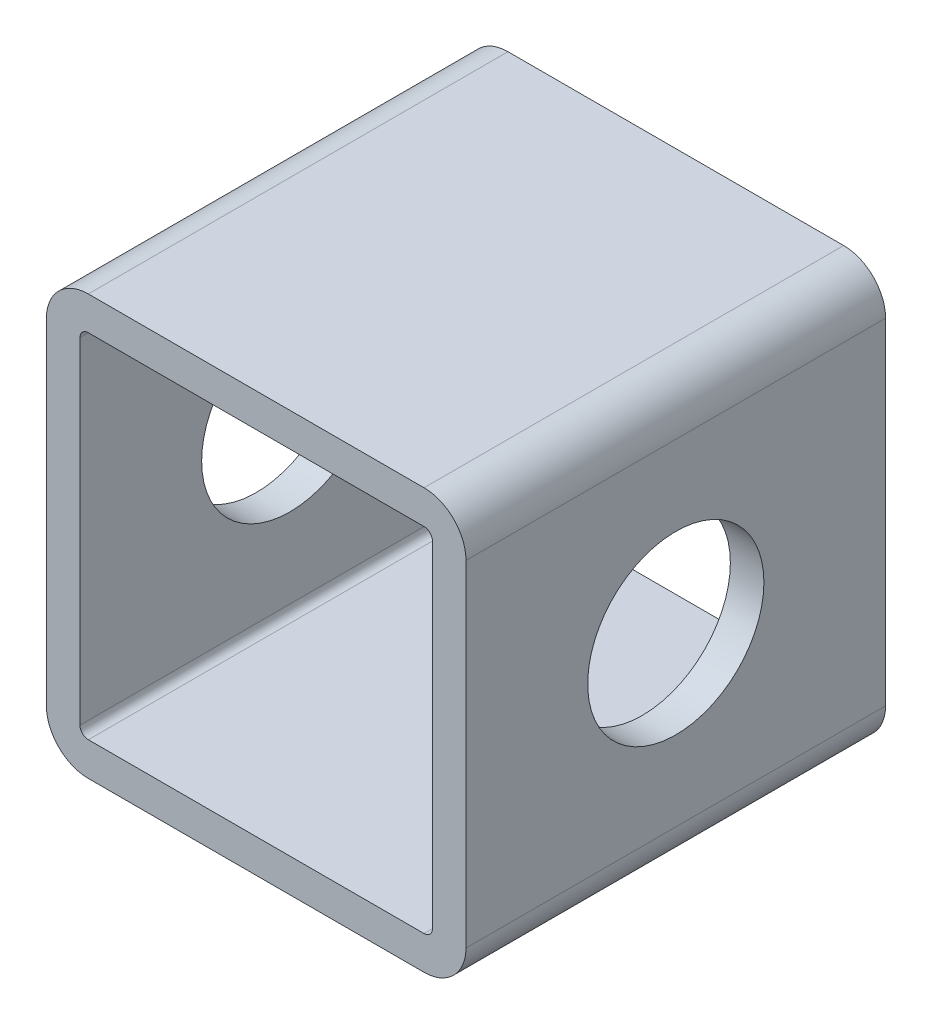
ISO-10303-21;
HEADER;
FILE_DESCRIPTION(('STEP AP214'),'2;1');
FILE_NAME('part.step','',(''),(''),'','','');
FILE_SCHEMA(('AUTOMOTIVE_DESIGN { 1 0 10303 214 1 1 1 1 }'));
ENDSEC;
DATA;
#1=APPLICATION_CONTEXT('core data for automotive mechanical design processes');
#2=APPLICATION_PROTOCOL_DEFINITION('international standard','automotive_design',2000,#1);
#3=PRODUCT_CONTEXT('',#1,'mechanical');
#4=PRODUCT('Part','Part','',(#3));
#5=PRODUCT_RELATED_PRODUCT_CATEGORY('part','',(#4));
#6=PRODUCT_DEFINITION_FORMATION('','',#4);
#7=PRODUCT_DEFINITION_CONTEXT('part definition',#1,'design');
#8=PRODUCT_DEFINITION('design','',#6,#7);
#9=PRODUCT_DEFINITION_SHAPE('','',#8);
#10=(LENGTH_UNIT() NAMED_UNIT(*) SI_UNIT(.MILLI.,.METRE.));
#11=(NAMED_UNIT(*) PLANE_ANGLE_UNIT() SI_UNIT($,.RADIAN.));
#12=(NAMED_UNIT(*) SI_UNIT($,.STERADIAN.) SOLID_ANGLE_UNIT());
#13=UNCERTAINTY_MEASURE_WITH_UNIT(LENGTH_MEASURE(1.E-05),#10,'distance_accuracy_value','');
#14=(GEOMETRIC_REPRESENTATION_CONTEXT(3) GLOBAL_UNCERTAINTY_ASSIGNED_CONTEXT((#13)) GLOBAL_UNIT_ASSIGNED_CONTEXT((#10,
#11,#12)) REPRESENTATION_CONTEXT('',''));
#15=CARTESIAN_POINT('',(0.,0.,0.));
#16=DIRECTION('',(0.,0.,1.));
#17=DIRECTION('',(1.,0.,0.));
#18=AXIS2_PLACEMENT_3D('',#15,#16,#17);
#19=CARTESIAN_POINT('',(45.,-45.,50.));
#20=DIRECTION('',(0.,0.,1.));
#21=DIRECTION('',(1.,0.,0.));
#22=AXIS2_PLACEMENT_3D('',#19,#20,#21);
#23=PLANE('',#22);
#24=CARTESIAN_POINT('',(45.,-45.,50.));
#25=DIRECTION('',(0.,0.,1.));
#26=DIRECTION('',(1.,0.,0.));
#27=AXIS2_PLACEMENT_3D('',#24,#25,#26);
#28=CIRCLE('',#27,5.);
#29=CARTESIAN_POINT('',(45.,-50.,50.));
#30=VERTEX_POINT('',#29);
#31=CARTESIAN_POINT('',(50.,-45.,50.));
#32=VERTEX_POINT('',#31);
#33=EDGE_CURVE('E227',#30,#32,#28,.T.);
#34=ORIENTED_EDGE('',*,*,#33,.T.);
#35=DIRECTION('',(0.,1.,0.));
#36=VECTOR('',#35,1.);
#37=CARTESIAN_POINT('',(50.,-5.00000000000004,50.));
#38=LINE('',#37,#36);
#39=CARTESIAN_POINT('',(50.,-5.00000000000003,50.));
#40=VERTEX_POINT('',#39);
#41=EDGE_CURVE('E230',#32,#40,#38,.T.);
#42=ORIENTED_EDGE('',*,*,#41,.T.);
#43=CARTESIAN_POINT('',(45.,-5.,50.));
#44=DIRECTION('',(0.,0.,1.));
#45=DIRECTION('',(-1.,0.,0.));
#46=AXIS2_PLACEMENT_3D('',#43,#44,#45);
#47=CIRCLE('',#46,5.);
#48=CARTESIAN_POINT('',(45.,0.,50.));
#49=VERTEX_POINT('',#48);
#50=EDGE_CURVE('E232',#40,#49,#47,.T.);
#51=ORIENTED_EDGE('',*,*,#50,.T.);
#52=DIRECTION('',(-1.,0.,0.));
#53=VECTOR('',#52,1.);
#54=CARTESIAN_POINT('',(5.00000000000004,0.,50.));
#55=LINE('',#54,#53);
#56=CARTESIAN_POINT('',(5.00000000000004,0.,50.));
#57=VERTEX_POINT('',#56);
#58=EDGE_CURVE('E234',#49,#57,#55,.T.);
#59=ORIENTED_EDGE('',*,*,#58,.T.);
#60=CARTESIAN_POINT('',(5.,-5.,50.));
#61=DIRECTION('',(0.,0.,1.));
#62=DIRECTION('',(-1.,0.,0.));
#63=AXIS2_PLACEMENT_3D('',#60,#61,#62);
#64=CIRCLE('',#63,5.);
#65=CARTESIAN_POINT('',(0.,-5.00000000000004,50.));
#66=VERTEX_POINT('',#65);
#67=EDGE_CURVE('E236',#57,#66,#64,.T.);
#68=ORIENTED_EDGE('',*,*,#67,.T.);
#69=DIRECTION('',(0.,-1.,0.));
#70=VECTOR('',#69,1.);
#71=CARTESIAN_POINT('',(0.,-5.00000000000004,50.));
#72=LINE('',#71,#70);
#73=CARTESIAN_POINT('',(0.,-45.,50.));
#74=VERTEX_POINT('',#73);
#75=EDGE_CURVE('E238',#66,#74,#72,.T.);
#76=ORIENTED_EDGE('',*,*,#75,.T.);
#77=CARTESIAN_POINT('',(5.00000000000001,-45.,50.));
#78=DIRECTION('',(0.,0.,1.));
#79=DIRECTION('',(-1.,0.,0.));
#80=AXIS2_PLACEMENT_3D('',#77,#78,#79);
#81=CIRCLE('',#80,5.);
#82=CARTESIAN_POINT('',(5.00000000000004,-50.,50.));
#83=VERTEX_POINT('',#82);
#84=EDGE_CURVE('E240',#74,#83,#81,.T.);
#85=ORIENTED_EDGE('',*,*,#84,.T.);
#86=DIRECTION('',(1.,0.,0.));
#87=VECTOR('',#86,1.);
#88=CARTESIAN_POINT('',(5.00000000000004,-50.,50.));
#89=LINE('',#88,#87);
#90=EDGE_CURVE('E242',#83,#30,#89,.T.);
#91=ORIENTED_EDGE('',*,*,#90,.T.);
#92=EDGE_LOOP('',(#34,#42,#51,#59,#68,#76,#85,#91));
#93=FACE_BOUND('',#92,.T.);
#94=DIRECTION('',(0.,-1.,0.));
#95=VECTOR('',#94,1.);
#96=CARTESIAN_POINT('',(4.,-5.00000000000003,50.));
#97=LINE('',#96,#95);
#98=CARTESIAN_POINT('',(4.,-5.00000000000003,50.));
#99=VERTEX_POINT('',#98);
#100=CARTESIAN_POINT('',(4.00000000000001,-45.,50.));
#101=VERTEX_POINT('',#100);
#102=EDGE_CURVE('E185',#99,#101,#97,.T.);
#103=ORIENTED_EDGE('',*,*,#102,.F.);
#104=CARTESIAN_POINT('',(5.,-5.,50.));
#105=DIRECTION('',(0.,0.,1.));
#106=DIRECTION('',(-1.,0.,0.));
#107=AXIS2_PLACEMENT_3D('',#104,#105,#106);
#108=CIRCLE('',#107,0.999999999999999);
#109=CARTESIAN_POINT('',(5.00000000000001,-4.,50.));
#110=VERTEX_POINT('',#109);
#111=EDGE_CURVE('E158',#110,#99,#108,.T.);
#112=ORIENTED_EDGE('',*,*,#111,.F.);
#113=DIRECTION('',(-1.,0.,0.));
#114=VECTOR('',#113,1.);
#115=CARTESIAN_POINT('',(5.00000000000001,-4.,50.));
#116=LINE('',#115,#114);
#117=CARTESIAN_POINT('',(45.,-4.,50.));
#118=VERTEX_POINT('',#117);
#119=EDGE_CURVE('E197',#118,#110,#116,.T.);
#120=ORIENTED_EDGE('',*,*,#119,.F.);
#121=CARTESIAN_POINT('',(45.,-5.,50.));
#122=DIRECTION('',(0.,0.,1.));
#123=DIRECTION('',(-1.,0.,0.));
#124=AXIS2_PLACEMENT_3D('',#121,#122,#123);
#125=CIRCLE('',#124,1.);
#126=CARTESIAN_POINT('',(46.,-5.00000000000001,50.));
#127=VERTEX_POINT('',#126);
#128=EDGE_CURVE('E195',#127,#118,#125,.T.);
#129=ORIENTED_EDGE('',*,*,#128,.F.);
#130=DIRECTION('',(0.,1.,0.));
#131=VECTOR('',#130,1.);
#132=CARTESIAN_POINT('',(46.,-5.00000000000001,50.));
#133=LINE('',#132,#131);
#134=CARTESIAN_POINT('',(46.,-45.,50.));
#135=VERTEX_POINT('',#134);
#136=EDGE_CURVE('E193',#135,#127,#133,.T.);
#137=ORIENTED_EDGE('',*,*,#136,.F.);
#138=CARTESIAN_POINT('',(45.,-45.,50.));
#139=DIRECTION('',(0.,0.,1.));
#140=DIRECTION('',(1.,0.,0.));
#141=AXIS2_PLACEMENT_3D('',#138,#139,#140);
#142=CIRCLE('',#141,0.999999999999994);
#143=CARTESIAN_POINT('',(45.,-46.,50.));
#144=VERTEX_POINT('',#143);
#145=EDGE_CURVE('E191',#144,#135,#142,.T.);
#146=ORIENTED_EDGE('',*,*,#145,.F.);
#147=DIRECTION('',(1.,0.,0.));
#148=VECTOR('',#147,1.);
#149=CARTESIAN_POINT('',(5.00000000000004,-46.,50.));
#150=LINE('',#149,#148);
#151=CARTESIAN_POINT('',(5.00000000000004,-46.,50.));
#152=VERTEX_POINT('',#151);
#153=EDGE_CURVE('E189',#152,#144,#150,.T.);
#154=ORIENTED_EDGE('',*,*,#153,.F.);
#155=CARTESIAN_POINT('',(5.00000000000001,-45.,50.));
#156=DIRECTION('',(0.,0.,1.));
#157=DIRECTION('',(-1.,0.,0.));
#158=AXIS2_PLACEMENT_3D('',#155,#156,#157);
#159=CIRCLE('',#158,0.999999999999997);
#160=EDGE_CURVE('E187',#101,#152,#159,.T.);
#161=ORIENTED_EDGE('',*,*,#160,.F.);
#162=EDGE_LOOP('',(#103,#112,#120,#129,#137,#146,#154,#161));
#163=FACE_BOUND('',#162,.T.);
#164=ADVANCED_FACE('F29',(#93,#163),#23,.T.);
#165=CARTESIAN_POINT('',(45.,-45.,0.));
#166=DIRECTION('',(0.,0.,1.));
#167=DIRECTION('',(1.,0.,0.));
#168=AXIS2_PLACEMENT_3D('',#165,#166,#167);
#169=PLANE('',#168);
#170=CARTESIAN_POINT('',(45.,-45.,0.));
#171=DIRECTION('',(0.,0.,1.));
#172=DIRECTION('',(1.,0.,0.));
#173=AXIS2_PLACEMENT_3D('',#170,#171,#172);
#174=CIRCLE('',#173,5.);
#175=CARTESIAN_POINT('',(45.,-50.,0.));
#176=VERTEX_POINT('',#175);
#177=CARTESIAN_POINT('',(50.,-45.,0.));
#178=VERTEX_POINT('',#177);
#179=EDGE_CURVE('E159',#176,#178,#174,.T.);
#180=ORIENTED_EDGE('',*,*,#179,.F.);
#181=DIRECTION('',(1.,0.,0.));
#182=VECTOR('',#181,1.);
#183=CARTESIAN_POINT('',(5.00000000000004,-50.,0.));
#184=LINE('',#183,#182);
#185=CARTESIAN_POINT('',(5.00000000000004,-50.,0.));
#186=VERTEX_POINT('',#185);
#187=EDGE_CURVE('E225',#186,#176,#184,.T.);
#188=ORIENTED_EDGE('',*,*,#187,.F.);
#189=CARTESIAN_POINT('',(5.00000000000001,-45.,0.));
#190=DIRECTION('',(0.,0.,1.));
#191=DIRECTION('',(-1.,0.,0.));
#192=AXIS2_PLACEMENT_3D('',#189,#190,#191);
#193=CIRCLE('',#192,5.);
#194=CARTESIAN_POINT('',(0.,-45.,0.));
#195=VERTEX_POINT('',#194);
#196=EDGE_CURVE('E223',#195,#186,#193,.T.);
#197=ORIENTED_EDGE('',*,*,#196,.F.);
#198=DIRECTION('',(0.,-1.,0.));
#199=VECTOR('',#198,1.);
#200=CARTESIAN_POINT('',(0.,-5.00000000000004,0.));
#201=LINE('',#200,#199);
#202=CARTESIAN_POINT('',(0.,-5.00000000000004,0.));
#203=VERTEX_POINT('',#202);
#204=EDGE_CURVE('E221',#203,#195,#201,.T.);
#205=ORIENTED_EDGE('',*,*,#204,.F.);
#206=CARTESIAN_POINT('',(5.,-5.,0.));
#207=DIRECTION('',(0.,0.,1.));
#208=DIRECTION('',(-1.,0.,0.));
#209=AXIS2_PLACEMENT_3D('',#206,#207,#208);
#210=CIRCLE('',#209,5.);
#211=CARTESIAN_POINT('',(5.00000000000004,0.,0.));
#212=VERTEX_POINT('',#211);
#213=EDGE_CURVE('E219',#212,#203,#210,.T.);
#214=ORIENTED_EDGE('',*,*,#213,.F.);
#215=DIRECTION('',(-1.,0.,0.));
#216=VECTOR('',#215,1.);
#217=CARTESIAN_POINT('',(5.00000000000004,0.,0.));
#218=LINE('',#217,#216);
#219=CARTESIAN_POINT('',(45.,0.,0.));
#220=VERTEX_POINT('',#219);
#221=EDGE_CURVE('E217',#220,#212,#218,.T.);
#222=ORIENTED_EDGE('',*,*,#221,.F.);
#223=CARTESIAN_POINT('',(45.,-5.,0.));
#224=DIRECTION('',(0.,0.,1.));
#225=DIRECTION('',(-1.,0.,0.));
#226=AXIS2_PLACEMENT_3D('',#223,#224,#225);
#227=CIRCLE('',#226,5.);
#228=CARTESIAN_POINT('',(50.,-5.00000000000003,0.));
#229=VERTEX_POINT('',#228);
#230=EDGE_CURVE('E215',#229,#220,#227,.T.);
#231=ORIENTED_EDGE('',*,*,#230,.F.);
#232=DIRECTION('',(0.,1.,0.));
#233=VECTOR('',#232,1.);
#234=CARTESIAN_POINT('',(50.,-5.00000000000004,0.));
#235=LINE('',#234,#233);
#236=EDGE_CURVE('E213',#178,#229,#235,.T.);
#237=ORIENTED_EDGE('',*,*,#236,.F.);
#238=EDGE_LOOP('',(#180,#188,#197,#205,#214,#222,#231,#237));
#239=FACE_BOUND('',#238,.T.);
#240=CARTESIAN_POINT('',(5.,-5.,0.));
#241=DIRECTION('',(0.,0.,1.));
#242=DIRECTION('',(-1.,0.,0.));
#243=AXIS2_PLACEMENT_3D('',#240,#241,#242);
#244=CIRCLE('',#243,0.999999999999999);
#245=CARTESIAN_POINT('',(5.00000000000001,-4.,0.));
#246=VERTEX_POINT('',#245);
#247=CARTESIAN_POINT('',(4.,-5.00000000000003,0.));
#248=VERTEX_POINT('',#247);
#249=EDGE_CURVE('E53',#246,#248,#244,.T.);
#250=ORIENTED_EDGE('',*,*,#249,.T.);
#251=DIRECTION('',(0.,-1.,0.));
#252=VECTOR('',#251,1.);
#253=CARTESIAN_POINT('',(4.,-5.00000000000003,0.));
#254=LINE('',#253,#252);
#255=CARTESIAN_POINT('',(4.00000000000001,-45.,0.));
#256=VERTEX_POINT('',#255);
#257=EDGE_CURVE('E145',#248,#256,#254,.T.);
#258=ORIENTED_EDGE('',*,*,#257,.T.);
#259=CARTESIAN_POINT('',(5.00000000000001,-45.,0.));
#260=DIRECTION('',(0.,0.,1.));
#261=DIRECTION('',(-1.,0.,0.));
#262=AXIS2_PLACEMENT_3D('',#259,#260,#261);
#263=CIRCLE('',#262,0.999999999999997);
#264=CARTESIAN_POINT('',(5.00000000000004,-46.,0.));
#265=VERTEX_POINT('',#264);
#266=EDGE_CURVE('E154',#256,#265,#263,.T.);
#267=ORIENTED_EDGE('',*,*,#266,.T.);
#268=DIRECTION('',(1.,0.,0.));
#269=VECTOR('',#268,1.);
#270=CARTESIAN_POINT('',(5.00000000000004,-46.,0.));
#271=LINE('',#270,#269);
#272=CARTESIAN_POINT('',(45.,-46.,0.));
#273=VERTEX_POINT('',#272);
#274=EDGE_CURVE('E172',#265,#273,#271,.T.);
#275=ORIENTED_EDGE('',*,*,#274,.T.);
#276=CARTESIAN_POINT('',(45.,-45.,0.));
#277=DIRECTION('',(0.,0.,1.));
#278=DIRECTION('',(1.,0.,0.));
#279=AXIS2_PLACEMENT_3D('',#276,#277,#278);
#280=CIRCLE('',#279,0.999999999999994);
#281=CARTESIAN_POINT('',(46.,-45.,0.));
#282=VERTEX_POINT('',#281);
#283=EDGE_CURVE('E175',#273,#282,#280,.T.);
#284=ORIENTED_EDGE('',*,*,#283,.T.);
#285=DIRECTION('',(0.,1.,0.));
#286=VECTOR('',#285,1.);
#287=CARTESIAN_POINT('',(46.,-5.00000000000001,0.));
#288=LINE('',#287,#286);
#289=CARTESIAN_POINT('',(46.,-5.00000000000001,0.));
#290=VERTEX_POINT('',#289);
#291=EDGE_CURVE('E178',#282,#290,#288,.T.);
#292=ORIENTED_EDGE('',*,*,#291,.T.);
#293=CARTESIAN_POINT('',(45.,-5.,0.));
#294=DIRECTION('',(0.,0.,1.));
#295=DIRECTION('',(-1.,0.,0.));
#296=AXIS2_PLACEMENT_3D('',#293,#294,#295);
#297=CIRCLE('',#296,1.);
#298=CARTESIAN_POINT('',(45.,-4.,0.));
#299=VERTEX_POINT('',#298);
#300=EDGE_CURVE('E181',#290,#299,#297,.T.);
#301=ORIENTED_EDGE('',*,*,#300,.T.);
#302=DIRECTION('',(-1.,0.,0.));
#303=VECTOR('',#302,1.);
#304=CARTESIAN_POINT('',(5.00000000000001,-4.,0.));
#305=LINE('',#304,#303);
#306=EDGE_CURVE('E164',#299,#246,#305,.T.);
#307=ORIENTED_EDGE('',*,*,#306,.T.);
#308=EDGE_LOOP('',(#250,#258,#267,#275,#284,#292,#301,#307));
#309=FACE_BOUND('',#308,.T.);
#310=ADVANCED_FACE('F162',(#239,#309),#169,.F.);
#311=CARTESIAN_POINT('',(45.,-45.,50.));
#312=DIRECTION('',(0.,0.,-1.));
#313=DIRECTION('',(-1.,0.,0.));
#314=AXIS2_PLACEMENT_3D('',#311,#312,#313);
#315=CYLINDRICAL_SURFACE('',#314,5.);
#316=ORIENTED_EDGE('',*,*,#179,.T.);
#317=DIRECTION('',(0.,0.,-1.));
#318=VECTOR('',#317,1.);
#319=CARTESIAN_POINT('',(50.,-45.,50.));
#320=LINE('',#319,#318);
#321=EDGE_CURVE('E11',#32,#178,#320,.T.);
#322=ORIENTED_EDGE('',*,*,#321,.F.);
#323=ORIENTED_EDGE('',*,*,#33,.F.);
#324=DIRECTION('',(0.,0.,-1.));
#325=VECTOR('',#324,1.);
#326=CARTESIAN_POINT('',(45.,-50.,50.));
#327=LINE('',#326,#325);
#328=EDGE_CURVE('E244',#30,#176,#327,.T.);
#329=ORIENTED_EDGE('',*,*,#328,.T.);
#330=EDGE_LOOP('',(#316,#322,#323,#329));
#331=FACE_BOUND('',#330,.T.);
#332=ADVANCED_FACE('F31',(#331),#315,.T.);
#333=CARTESIAN_POINT('',(50.,-5.00000000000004,50.));
#334=DIRECTION('',(-1.,0.,0.));
#335=DIRECTION('',(0.,0.,1.));
#336=AXIS2_PLACEMENT_3D('',#333,#334,#335);
#337=PLANE('',#336);
#338=CARTESIAN_POINT('',(50.,-25.,25.));
#339=DIRECTION('',(1.,0.,0.));
#340=DIRECTION('',(0.,0.,-1.));
#341=AXIS2_PLACEMENT_3D('',#338,#339,#340);
#342=CIRCLE('',#341,10.5);
#343=CARTESIAN_POINT('',(50.,-25.,14.5));
#344=VERTEX_POINT('',#343);
#345=EDGE_CURVE('E367',#344,#344,#342,.T.);
#346=ORIENTED_EDGE('',*,*,#345,.F.);
#347=EDGE_LOOP('',(#346));
#348=FACE_BOUND('',#347,.T.);
#349=ORIENTED_EDGE('',*,*,#236,.T.);
#350=DIRECTION('',(0.,0.,-1.));
#351=VECTOR('',#350,1.);
#352=CARTESIAN_POINT('',(50.,-5.00000000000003,50.));
#353=LINE('',#352,#351);
#354=EDGE_CURVE('E38',#40,#229,#353,.T.);
#355=ORIENTED_EDGE('',*,*,#354,.F.);
#356=ORIENTED_EDGE('',*,*,#41,.F.);
#357=ORIENTED_EDGE('',*,*,#321,.T.);
#358=EDGE_LOOP('',(#349,#355,#356,#357));
#359=FACE_BOUND('',#358,.T.);
#360=ADVANCED_FACE('F289',(#348,#359),#337,.F.);
#361=CARTESIAN_POINT('',(45.,-5.,50.));
#362=DIRECTION('',(0.,0.,-1.));
#363=DIRECTION('',(-1.,0.,0.));
#364=AXIS2_PLACEMENT_3D('',#361,#362,#363);
#365=CYLINDRICAL_SURFACE('',#364,5.);
#366=ORIENTED_EDGE('',*,*,#230,.T.);
#367=DIRECTION('',(0.,0.,-1.));
#368=VECTOR('',#367,1.);
#369=CARTESIAN_POINT('',(45.,0.,50.));
#370=LINE('',#369,#368);
#371=EDGE_CURVE('E259',#49,#220,#370,.T.);
#372=ORIENTED_EDGE('',*,*,#371,.F.);
#373=ORIENTED_EDGE('',*,*,#50,.F.);
#374=ORIENTED_EDGE('',*,*,#354,.T.);
#375=EDGE_LOOP('',(#366,#372,#373,#374));
#376=FACE_BOUND('',#375,.T.);
#377=ADVANCED_FACE('F267',(#376),#365,.T.);
#378=CARTESIAN_POINT('',(5.00000000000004,0.,50.));
#379=DIRECTION('',(0.,-1.,0.));
#380=DIRECTION('',(0.,0.,-1.));
#381=AXIS2_PLACEMENT_3D('',#378,#379,#380);
#382=PLANE('',#381);
#383=ORIENTED_EDGE('',*,*,#221,.T.);
#384=DIRECTION('',(0.,0.,-1.));
#385=VECTOR('',#384,1.);
#386=CARTESIAN_POINT('',(5.00000000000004,0.,50.));
#387=LINE('',#386,#385);
#388=EDGE_CURVE('E256',#57,#212,#387,.T.);
#389=ORIENTED_EDGE('',*,*,#388,.F.);
#390=ORIENTED_EDGE('',*,*,#58,.F.);
#391=ORIENTED_EDGE('',*,*,#371,.T.);
#392=EDGE_LOOP('',(#383,#389,#390,#391));
#393=FACE_BOUND('',#392,.T.);
#394=ADVANCED_FACE('F277',(#393),#382,.F.);
#395=CARTESIAN_POINT('',(5.,-5.,50.));
#396=DIRECTION('',(0.,0.,-1.));
#397=DIRECTION('',(-1.,0.,0.));
#398=AXIS2_PLACEMENT_3D('',#395,#396,#397);
#399=CYLINDRICAL_SURFACE('',#398,5.);
#400=ORIENTED_EDGE('',*,*,#213,.T.);
#401=DIRECTION('',(0.,0.,-1.));
#402=VECTOR('',#401,1.);
#403=CARTESIAN_POINT('',(0.,-5.00000000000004,50.));
#404=LINE('',#403,#402);
#405=EDGE_CURVE('E253',#66,#203,#404,.T.);
#406=ORIENTED_EDGE('',*,*,#405,.F.);
#407=ORIENTED_EDGE('',*,*,#67,.F.);
#408=ORIENTED_EDGE('',*,*,#388,.T.);
#409=EDGE_LOOP('',(#400,#406,#407,#408));
#410=FACE_BOUND('',#409,.T.);
#411=ADVANCED_FACE('F281',(#410),#399,.T.);
#412=CARTESIAN_POINT('',(0.,-5.00000000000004,50.));
#413=DIRECTION('',(1.,0.,0.));
#414=DIRECTION('',(0.,1.,0.));
#415=AXIS2_PLACEMENT_3D('',#412,#413,#414);
#416=PLANE('',#415);
#417=CARTESIAN_POINT('',(0.,-25.,25.));
#418=DIRECTION('',(1.,0.,0.));
#419=DIRECTION('',(0.,0.,-1.));
#420=AXIS2_PLACEMENT_3D('',#417,#418,#419);
#421=CIRCLE('',#420,10.5);
#422=CARTESIAN_POINT('',(0.,-25.,14.5));
#423=VERTEX_POINT('',#422);
#424=EDGE_CURVE('E369',#423,#423,#421,.T.);
#425=ORIENTED_EDGE('',*,*,#424,.T.);
#426=EDGE_LOOP('',(#425));
#427=FACE_BOUND('',#426,.T.);
#428=ORIENTED_EDGE('',*,*,#204,.T.);
#429=DIRECTION('',(0.,0.,-1.));
#430=VECTOR('',#429,1.);
#431=CARTESIAN_POINT('',(0.,-45.,50.));
#432=LINE('',#431,#430);
#433=EDGE_CURVE('E250',#74,#195,#432,.T.);
#434=ORIENTED_EDGE('',*,*,#433,.F.);
#435=ORIENTED_EDGE('',*,*,#75,.F.);
#436=ORIENTED_EDGE('',*,*,#405,.T.);
#437=EDGE_LOOP('',(#428,#434,#435,#436));
#438=FACE_BOUND('',#437,.T.);
#439=ADVANCED_FACE('F302',(#427,#438),#416,.F.);
#440=CARTESIAN_POINT('',(5.00000000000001,-45.,50.));
#441=DIRECTION('',(0.,0.,-1.));
#442=DIRECTION('',(-1.,0.,0.));
#443=AXIS2_PLACEMENT_3D('',#440,#441,#442);
#444=CYLINDRICAL_SURFACE('',#443,5.);
#445=ORIENTED_EDGE('',*,*,#196,.T.);
#446=DIRECTION('',(0.,0.,-1.));
#447=VECTOR('',#446,1.);
#448=CARTESIAN_POINT('',(5.00000000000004,-50.,50.));
#449=LINE('',#448,#447);
#450=EDGE_CURVE('E247',#83,#186,#449,.T.);
#451=ORIENTED_EDGE('',*,*,#450,.F.);
#452=ORIENTED_EDGE('',*,*,#84,.F.);
#453=ORIENTED_EDGE('',*,*,#433,.T.);
#454=EDGE_LOOP('',(#445,#451,#452,#453));
#455=FACE_BOUND('',#454,.T.);
#456=ADVANCED_FACE('F300',(#455),#444,.T.);
#457=CARTESIAN_POINT('',(5.00000000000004,-50.,50.));
#458=DIRECTION('',(0.,1.,0.));
#459=DIRECTION('',(0.,0.,1.));
#460=AXIS2_PLACEMENT_3D('',#457,#458,#459);
#461=PLANE('',#460);
#462=ORIENTED_EDGE('',*,*,#187,.T.);
#463=ORIENTED_EDGE('',*,*,#328,.F.);
#464=ORIENTED_EDGE('',*,*,#90,.F.);
#465=ORIENTED_EDGE('',*,*,#450,.T.);
#466=EDGE_LOOP('',(#462,#463,#464,#465));
#467=FACE_BOUND('',#466,.T.);
#468=ADVANCED_FACE('F295',(#467),#461,.F.);
#469=CARTESIAN_POINT('',(5.,-5.,50.));
#470=DIRECTION('',(0.,0.,-1.));
#471=DIRECTION('',(-1.,0.,0.));
#472=AXIS2_PLACEMENT_3D('',#469,#470,#471);
#473=CYLINDRICAL_SURFACE('',#472,0.999999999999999);
#474=ORIENTED_EDGE('',*,*,#249,.F.);
#475=DIRECTION('',(0.,0.,-1.));
#476=VECTOR('',#475,1.);
#477=CARTESIAN_POINT('',(5.00000000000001,-4.,50.));
#478=LINE('',#477,#476);
#479=EDGE_CURVE('E199',#110,#246,#478,.T.);
#480=ORIENTED_EDGE('',*,*,#479,.F.);
#481=ORIENTED_EDGE('',*,*,#111,.T.);
#482=DIRECTION('',(0.,0.,-1.));
#483=VECTOR('',#482,1.);
#484=CARTESIAN_POINT('',(4.,-5.00000000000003,50.));
#485=LINE('',#484,#483);
#486=EDGE_CURVE('E147',#99,#248,#485,.T.);
#487=ORIENTED_EDGE('',*,*,#486,.T.);
#488=EDGE_LOOP('',(#474,#480,#481,#487));
#489=FACE_BOUND('',#488,.T.);
#490=ADVANCED_FACE('F156',(#489),#473,.F.);
#491=CARTESIAN_POINT('',(4.,-5.00000000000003,50.));
#492=DIRECTION('',(1.,0.,0.));
#493=DIRECTION('',(0.,1.,0.));
#494=AXIS2_PLACEMENT_3D('',#491,#492,#493);
#495=PLANE('',#494);
#496=CARTESIAN_POINT('',(4.,-25.,25.));
#497=DIRECTION('',(1.,0.,0.));
#498=DIRECTION('',(0.,1.,0.));
#499=AXIS2_PLACEMENT_3D('',#496,#497,#498);
#500=CIRCLE('',#499,10.5);
#501=CARTESIAN_POINT('',(4.,-14.5,25.));
#502=VERTEX_POINT('',#501);
#503=EDGE_CURVE('E165',#502,#502,#500,.T.);
#504=ORIENTED_EDGE('',*,*,#503,.F.);
#505=EDGE_LOOP('',(#504));
#506=FACE_BOUND('',#505,.T.);
#507=ORIENTED_EDGE('',*,*,#257,.F.);
#508=ORIENTED_EDGE('',*,*,#486,.F.);
#509=ORIENTED_EDGE('',*,*,#102,.T.);
#510=DIRECTION('',(0.,0.,-1.));
#511=VECTOR('',#510,1.);
#512=CARTESIAN_POINT('',(4.00000000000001,-45.,50.));
#513=LINE('',#512,#511);
#514=EDGE_CURVE('E150',#101,#256,#513,.T.);
#515=ORIENTED_EDGE('',*,*,#514,.T.);
#516=EDGE_LOOP('',(#507,#508,#509,#515));
#517=FACE_BOUND('',#516,.T.);
#518=ADVANCED_FACE('F146',(#506,#517),#495,.T.);
#519=CARTESIAN_POINT('',(5.00000000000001,-45.,50.));
#520=DIRECTION('',(0.,0.,-1.));
#521=DIRECTION('',(-1.,0.,0.));
#522=AXIS2_PLACEMENT_3D('',#519,#520,#521);
#523=CYLINDRICAL_SURFACE('',#522,0.999999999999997);
#524=ORIENTED_EDGE('',*,*,#266,.F.);
#525=ORIENTED_EDGE('',*,*,#514,.F.);
#526=ORIENTED_EDGE('',*,*,#160,.T.);
#527=DIRECTION('',(0.,0.,-1.));
#528=VECTOR('',#527,1.);
#529=CARTESIAN_POINT('',(5.00000000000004,-46.,50.));
#530=LINE('',#529,#528);
#531=EDGE_CURVE('E208',#152,#265,#530,.T.);
#532=ORIENTED_EDGE('',*,*,#531,.T.);
#533=EDGE_LOOP('',(#524,#525,#526,#532));
#534=FACE_BOUND('',#533,.T.);
#535=ADVANCED_FACE('F328',(#534),#523,.F.);
#536=CARTESIAN_POINT('',(5.00000000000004,-46.,50.));
#537=DIRECTION('',(0.,1.,0.));
#538=DIRECTION('',(0.,0.,1.));
#539=AXIS2_PLACEMENT_3D('',#536,#537,#538);
#540=PLANE('',#539);
#541=ORIENTED_EDGE('',*,*,#274,.F.);
#542=ORIENTED_EDGE('',*,*,#531,.F.);
#543=ORIENTED_EDGE('',*,*,#153,.T.);
#544=DIRECTION('',(0.,0.,-1.));
#545=VECTOR('',#544,1.);
#546=CARTESIAN_POINT('',(45.,-46.,50.));
#547=LINE('',#546,#545);
#548=EDGE_CURVE('E206',#144,#273,#547,.T.);
#549=ORIENTED_EDGE('',*,*,#548,.T.);
#550=EDGE_LOOP('',(#541,#542,#543,#549));
#551=FACE_BOUND('',#550,.T.);
#552=ADVANCED_FACE('F334',(#551),#540,.T.);
#553=CARTESIAN_POINT('',(45.,-45.,50.));
#554=DIRECTION('',(0.,0.,-1.));
#555=DIRECTION('',(-1.,0.,0.));
#556=AXIS2_PLACEMENT_3D('',#553,#554,#555);
#557=CYLINDRICAL_SURFACE('',#556,0.999999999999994);
#558=ORIENTED_EDGE('',*,*,#283,.F.);
#559=ORIENTED_EDGE('',*,*,#548,.F.);
#560=ORIENTED_EDGE('',*,*,#145,.T.);
#561=DIRECTION('',(0.,0.,-1.));
#562=VECTOR('',#561,1.);
#563=CARTESIAN_POINT('',(46.,-45.,50.));
#564=LINE('',#563,#562);
#565=EDGE_CURVE('E204',#135,#282,#564,.T.);
#566=ORIENTED_EDGE('',*,*,#565,.T.);
#567=EDGE_LOOP('',(#558,#559,#560,#566));
#568=FACE_BOUND('',#567,.T.);
#569=ADVANCED_FACE('F338',(#568),#557,.F.);
#570=CARTESIAN_POINT('',(46.,-5.00000000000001,50.));
#571=DIRECTION('',(-1.,0.,0.));
#572=DIRECTION('',(0.,-1.,0.));
#573=AXIS2_PLACEMENT_3D('',#570,#571,#572);
#574=PLANE('',#573);
#575=CARTESIAN_POINT('',(46.,-25.,25.));
#576=DIRECTION('',(-1.,0.,0.));
#577=DIRECTION('',(0.,-1.,0.));
#578=AXIS2_PLACEMENT_3D('',#575,#576,#577);
#579=CIRCLE('',#578,10.5);
#580=CARTESIAN_POINT('',(46.,-35.5,25.));
#581=VERTEX_POINT('',#580);
#582=EDGE_CURVE('E33',#581,#581,#579,.T.);
#583=ORIENTED_EDGE('',*,*,#582,.F.);
#584=EDGE_LOOP('',(#583));
#585=FACE_BOUND('',#584,.T.);
#586=ORIENTED_EDGE('',*,*,#291,.F.);
#587=ORIENTED_EDGE('',*,*,#565,.F.);
#588=ORIENTED_EDGE('',*,*,#136,.T.);
#589=DIRECTION('',(0.,0.,-1.));
#590=VECTOR('',#589,1.);
#591=CARTESIAN_POINT('',(46.,-5.00000000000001,50.));
#592=LINE('',#591,#590);
#593=EDGE_CURVE('E202',#127,#290,#592,.T.);
#594=ORIENTED_EDGE('',*,*,#593,.T.);
#595=EDGE_LOOP('',(#586,#587,#588,#594));
#596=FACE_BOUND('',#595,.T.);
#597=ADVANCED_FACE('F342',(#585,#596),#574,.T.);
#598=CARTESIAN_POINT('',(45.,-5.,50.));
#599=DIRECTION('',(0.,0.,-1.));
#600=DIRECTION('',(-1.,0.,0.));
#601=AXIS2_PLACEMENT_3D('',#598,#599,#600);
#602=CYLINDRICAL_SURFACE('',#601,1.);
#603=ORIENTED_EDGE('',*,*,#300,.F.);
#604=ORIENTED_EDGE('',*,*,#593,.F.);
#605=ORIENTED_EDGE('',*,*,#128,.T.);
#606=DIRECTION('',(0.,0.,-1.));
#607=VECTOR('',#606,1.);
#608=CARTESIAN_POINT('',(45.,-4.,50.));
#609=LINE('',#608,#607);
#610=EDGE_CURVE('E45',#118,#299,#609,.T.);
#611=ORIENTED_EDGE('',*,*,#610,.T.);
#612=EDGE_LOOP('',(#603,#604,#605,#611));
#613=FACE_BOUND('',#612,.T.);
#614=ADVANCED_FACE('F346',(#613),#602,.F.);
#615=CARTESIAN_POINT('',(5.00000000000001,-4.,50.));
#616=DIRECTION('',(0.,-1.,0.));
#617=DIRECTION('',(0.,0.,-1.));
#618=AXIS2_PLACEMENT_3D('',#615,#616,#617);
#619=PLANE('',#618);
#620=ORIENTED_EDGE('',*,*,#306,.F.);
#621=ORIENTED_EDGE('',*,*,#610,.F.);
#622=ORIENTED_EDGE('',*,*,#119,.T.);
#623=ORIENTED_EDGE('',*,*,#479,.T.);
#624=EDGE_LOOP('',(#620,#621,#622,#623));
#625=FACE_BOUND('',#624,.T.);
#626=ADVANCED_FACE('F350',(#625),#619,.T.);
#627=CARTESIAN_POINT('',(0.,-25.,25.));
#628=DIRECTION('',(1.,0.,0.));
#629=DIRECTION('',(0.,0.,-1.));
#630=AXIS2_PLACEMENT_3D('',#627,#628,#629);
#631=CYLINDRICAL_SURFACE('',#630,10.5);
#632=ORIENTED_EDGE('',*,*,#582,.T.);
#633=EDGE_LOOP('',(#632));
#634=FACE_BOUND('',#633,.T.);
#635=ORIENTED_EDGE('',*,*,#345,.T.);
#636=EDGE_LOOP('',(#635));
#637=FACE_BOUND('',#636,.T.);
#638=ADVANCED_FACE('F354',(#634,#637),#631,.F.);
#639=ORIENTED_EDGE('',*,*,#503,.T.);
#640=EDGE_LOOP('',(#639));
#641=FACE_BOUND('',#640,.T.);
#642=ORIENTED_EDGE('',*,*,#424,.F.);
#643=EDGE_LOOP('',(#642));
#644=FACE_BOUND('',#643,.T.);
#645=ADVANCED_FACE('F356',(#641,#644),#631,.F.);
#646=CLOSED_SHELL('',(#164,#310,#332,#360,#377,#394,#411,#439,#456,#468,#490,#518,#535,#552,
#569,#597,#614,#626,#638,#645));
#647=MANIFOLD_SOLID_BREP('B2',#646);
#648=ADVANCED_BREP_SHAPE_REPRESENTATION('',(#18,#647),#14);
#649=SHAPE_DEFINITION_REPRESENTATION(#9,#648);
ENDSEC;
END-ISO-10303-21;
